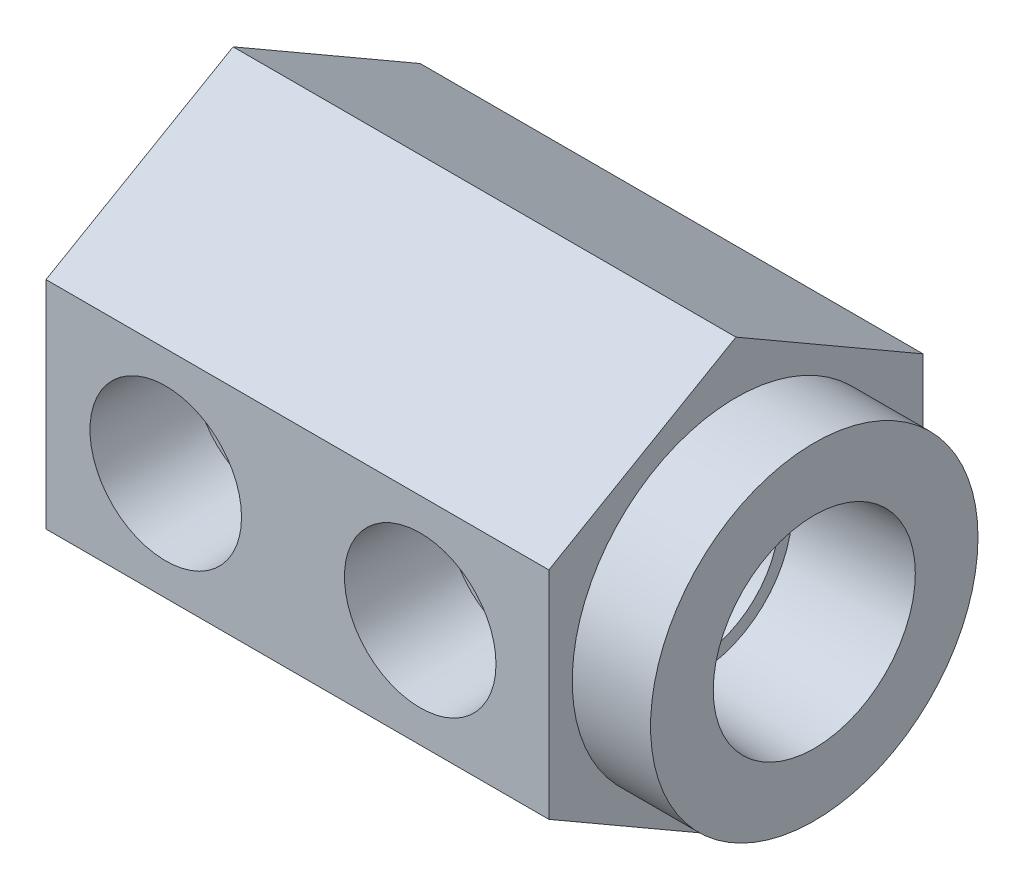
ISO-10303-21;
HEADER;
FILE_DESCRIPTION(('STEP AP214'),'2;1');
FILE_NAME('part.step','',(''),(''),'','','');
FILE_SCHEMA(('AUTOMOTIVE_DESIGN { 1 0 10303 214 1 1 1 1 }'));
ENDSEC;
DATA;
#1=APPLICATION_CONTEXT('core data for automotive mechanical design processes');
#2=APPLICATION_PROTOCOL_DEFINITION('international standard','automotive_design',2000,#1);
#3=PRODUCT_CONTEXT('',#1,'mechanical');
#4=PRODUCT('Part','Part','',(#3));
#5=PRODUCT_RELATED_PRODUCT_CATEGORY('part','',(#4));
#6=PRODUCT_DEFINITION_FORMATION('','',#4);
#7=PRODUCT_DEFINITION_CONTEXT('part definition',#1,'design');
#8=PRODUCT_DEFINITION('design','',#6,#7);
#9=PRODUCT_DEFINITION_SHAPE('','',#8);
#10=(LENGTH_UNIT() NAMED_UNIT(*) SI_UNIT(.MILLI.,.METRE.));
#11=(NAMED_UNIT(*) PLANE_ANGLE_UNIT() SI_UNIT($,.RADIAN.));
#12=(NAMED_UNIT(*) SI_UNIT($,.STERADIAN.) SOLID_ANGLE_UNIT());
#13=UNCERTAINTY_MEASURE_WITH_UNIT(LENGTH_MEASURE(1.E-05),#10,'distance_accuracy_value','');
#14=(GEOMETRIC_REPRESENTATION_CONTEXT(3) GLOBAL_UNCERTAINTY_ASSIGNED_CONTEXT((#13)) GLOBAL_UNIT_ASSIGNED_CONTEXT((#10,
#11,#12)) REPRESENTATION_CONTEXT('',''));
#15=CARTESIAN_POINT('',(0.,0.,0.));
#16=DIRECTION('',(0.,0.,1.));
#17=DIRECTION('',(1.,0.,0.));
#18=AXIS2_PLACEMENT_3D('',#15,#16,#17);
#19=CARTESIAN_POINT('',(39.44747,0.,0.));
#20=DIRECTION('',(1.,0.,0.));
#21=DIRECTION('',(0.,0.,-1.));
#22=AXIS2_PLACEMENT_3D('',#19,#20,#21);
#23=PLANE('',#22);
#24=CARTESIAN_POINT('',(39.44747,0.,0.));
#25=DIRECTION('',(1.,0.,0.));
#26=DIRECTION('',(0.,0.,-1.));
#27=AXIS2_PLACEMENT_3D('',#24,#25,#26);
#28=CIRCLE('',#27,11.1125);
#29=CARTESIAN_POINT('',(39.44747,0.,-11.1125));
#30=VERTEX_POINT('',#29);
#31=EDGE_CURVE('E130',#30,#30,#28,.T.);
#32=ORIENTED_EDGE('',*,*,#31,.T.);
#33=EDGE_LOOP('',(#32));
#34=FACE_BOUND('',#33,.T.);
#35=CARTESIAN_POINT('',(39.44747,0.,0.));
#36=DIRECTION('',(-1.,0.,0.));
#37=DIRECTION('',(0.,0.,1.));
#38=AXIS2_PLACEMENT_3D('',#35,#36,#37);
#39=CIRCLE('',#38,6.85806655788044);
#40=CARTESIAN_POINT('',(39.44747,0.,6.85806655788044));
#41=VERTEX_POINT('',#40);
#42=EDGE_CURVE('E256',#41,#41,#39,.T.);
#43=ORIENTED_EDGE('',*,*,#42,.T.);
#44=EDGE_LOOP('',(#43));
#45=FACE_BOUND('',#44,.T.);
#46=ADVANCED_FACE('F34',(#34,#45),#23,.T.);
#47=CARTESIAN_POINT('',(34.13125,-7.33234841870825,12.7));
#48=DIRECTION('',(1.,0.,0.));
#49=DIRECTION('',(0.,0.,-1.));
#50=AXIS2_PLACEMENT_3D('',#47,#48,#49);
#51=PLANE('',#50);
#52=DIRECTION('',(0.,-1.,0.));
#53=VECTOR('',#52,1.);
#54=CARTESIAN_POINT('',(34.13125,7.33234841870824,12.7));
#55=LINE('',#54,#53);
#56=CARTESIAN_POINT('',(34.13125,7.33234841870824,12.7));
#57=VERTEX_POINT('',#56);
#58=CARTESIAN_POINT('',(34.13125,-7.33234841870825,12.7));
#59=VERTEX_POINT('',#58);
#60=EDGE_CURVE('E137',#57,#59,#55,.T.);
#61=ORIENTED_EDGE('',*,*,#60,.T.);
#62=DIRECTION('',(0.,-0.5,-0.866025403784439));
#63=VECTOR('',#62,1.);
#64=CARTESIAN_POINT('',(34.13125,-7.33234841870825,12.7));
#65=LINE('',#64,#63);
#66=CARTESIAN_POINT('',(34.13125,-14.6646968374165,0.));
#67=VERTEX_POINT('',#66);
#68=EDGE_CURVE('E94',#59,#67,#65,.T.);
#69=ORIENTED_EDGE('',*,*,#68,.T.);
#70=DIRECTION('',(0.,0.5,-0.866025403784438));
#71=VECTOR('',#70,1.);
#72=CARTESIAN_POINT('',(34.13125,-14.6646968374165,0.));
#73=LINE('',#72,#71);
#74=CARTESIAN_POINT('',(34.13125,-7.33234841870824,-12.7));
#75=VERTEX_POINT('',#74);
#76=EDGE_CURVE('E108',#67,#75,#73,.T.);
#77=ORIENTED_EDGE('',*,*,#76,.T.);
#78=DIRECTION('',(0.,1.,0.));
#79=VECTOR('',#78,1.);
#80=CARTESIAN_POINT('',(34.13125,-7.33234841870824,-12.7));
#81=LINE('',#80,#79);
#82=CARTESIAN_POINT('',(34.13125,7.33234841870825,-12.7));
#83=VERTEX_POINT('',#82);
#84=EDGE_CURVE('E101',#75,#83,#81,.T.);
#85=ORIENTED_EDGE('',*,*,#84,.T.);
#86=DIRECTION('',(0.,0.5,0.866025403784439));
#87=VECTOR('',#86,1.);
#88=CARTESIAN_POINT('',(34.13125,7.33234841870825,-12.7));
#89=LINE('',#88,#87);
#90=CARTESIAN_POINT('',(34.13125,14.6646968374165,0.));
#91=VERTEX_POINT('',#90);
#92=EDGE_CURVE('E106',#83,#91,#89,.T.);
#93=ORIENTED_EDGE('',*,*,#92,.T.);
#94=DIRECTION('',(0.,-0.5,0.866025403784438));
#95=VECTOR('',#94,1.);
#96=CARTESIAN_POINT('',(34.13125,14.6646968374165,0.));
#97=LINE('',#96,#95);
#98=EDGE_CURVE('E57',#91,#57,#97,.T.);
#99=ORIENTED_EDGE('',*,*,#98,.T.);
#100=EDGE_LOOP('',(#61,#69,#77,#85,#93,#99));
#101=FACE_BOUND('',#100,.T.);
#102=CARTESIAN_POINT('',(34.13125,0.,0.));
#103=DIRECTION('',(1.,0.,0.));
#104=DIRECTION('',(0.,0.,-1.));
#105=AXIS2_PLACEMENT_3D('',#102,#103,#104);
#106=CIRCLE('',#105,11.1125);
#107=CARTESIAN_POINT('',(34.13125,0.,-11.1125));
#108=VERTEX_POINT('',#107);
#109=EDGE_CURVE('E249',#108,#108,#106,.T.);
#110=ORIENTED_EDGE('',*,*,#109,.F.);
#111=EDGE_LOOP('',(#110));
#112=FACE_BOUND('',#111,.T.);
#113=ADVANCED_FACE('F103',(#101,#112),#51,.T.);
#114=CARTESIAN_POINT('',(34.13125,7.33234841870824,12.7));
#115=DIRECTION('',(0.,0.,-1.));
#116=DIRECTION('',(0.,1.,0.));
#117=AXIS2_PLACEMENT_3D('',#114,#115,#116);
#118=PLANE('',#117);
#119=CARTESIAN_POINT('',(8.128,0.,12.7));
#120=DIRECTION('',(0.,0.,1.));
#121=DIRECTION('',(1.,0.,0.));
#122=AXIS2_PLACEMENT_3D('',#119,#120,#121);
#123=CIRCLE('',#122,5.1435);
#124=CARTESIAN_POINT('',(13.2715,0.,12.7));
#125=VERTEX_POINT('',#124);
#126=EDGE_CURVE('E278',#125,#125,#123,.T.);
#127=ORIENTED_EDGE('',*,*,#126,.F.);
#128=EDGE_LOOP('',(#127));
#129=FACE_BOUND('',#128,.T.);
#130=CARTESIAN_POINT('',(25.4,0.,12.7));
#131=DIRECTION('',(0.,0.,1.));
#132=DIRECTION('',(1.,0.,0.));
#133=AXIS2_PLACEMENT_3D('',#130,#131,#132);
#134=CIRCLE('',#133,5.1435);
#135=CARTESIAN_POINT('',(30.5435,0.,12.7));
#136=VERTEX_POINT('',#135);
#137=EDGE_CURVE('E269',#136,#136,#134,.T.);
#138=ORIENTED_EDGE('',*,*,#137,.F.);
#139=EDGE_LOOP('',(#138));
#140=FACE_BOUND('',#139,.T.);
#141=DIRECTION('',(0.,-1.,0.));
#142=VECTOR('',#141,1.);
#143=CARTESIAN_POINT('',(0.,7.33234841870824,12.7));
#144=LINE('',#143,#142);
#145=CARTESIAN_POINT('',(0.,7.33234841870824,12.7));
#146=VERTEX_POINT('',#145);
#147=CARTESIAN_POINT('',(0.,-7.33234841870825,12.7));
#148=VERTEX_POINT('',#147);
#149=EDGE_CURVE('E126',#146,#148,#144,.T.);
#150=ORIENTED_EDGE('',*,*,#149,.T.);
#151=DIRECTION('',(-1.,0.,0.));
#152=VECTOR('',#151,1.);
#153=CARTESIAN_POINT('',(34.13125,-7.33234841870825,12.7));
#154=LINE('',#153,#152);
#155=EDGE_CURVE('E11',#59,#148,#154,.T.);
#156=ORIENTED_EDGE('',*,*,#155,.F.);
#157=ORIENTED_EDGE('',*,*,#60,.F.);
#158=DIRECTION('',(-1.,0.,0.));
#159=VECTOR('',#158,1.);
#160=CARTESIAN_POINT('',(34.13125,7.33234841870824,12.7));
#161=LINE('',#160,#159);
#162=EDGE_CURVE('E122',#57,#146,#161,.T.);
#163=ORIENTED_EDGE('',*,*,#162,.T.);
#164=EDGE_LOOP('',(#150,#156,#157,#163));
#165=FACE_BOUND('',#164,.T.);
#166=ADVANCED_FACE('F36',(#129,#140,#165),#118,.F.);
#167=CARTESIAN_POINT('',(34.13125,-7.33234841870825,12.7));
#168=DIRECTION('',(0.,0.866025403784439,-0.5));
#169=DIRECTION('',(0.,0.5,0.866025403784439));
#170=AXIS2_PLACEMENT_3D('',#167,#168,#169);
#171=PLANE('',#170);
#172=DIRECTION('',(0.,-0.5,-0.866025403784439));
#173=VECTOR('',#172,1.);
#174=CARTESIAN_POINT('',(0.,-7.33234841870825,12.7));
#175=LINE('',#174,#173);
#176=CARTESIAN_POINT('',(0.,-14.6646968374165,0.));
#177=VERTEX_POINT('',#176);
#178=EDGE_CURVE('E129',#148,#177,#175,.T.);
#179=ORIENTED_EDGE('',*,*,#178,.T.);
#180=DIRECTION('',(-1.,0.,0.));
#181=VECTOR('',#180,1.);
#182=CARTESIAN_POINT('',(34.13125,-14.6646968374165,0.));
#183=LINE('',#182,#181);
#184=EDGE_CURVE('E48',#67,#177,#183,.T.);
#185=ORIENTED_EDGE('',*,*,#184,.F.);
#186=ORIENTED_EDGE('',*,*,#68,.F.);
#187=ORIENTED_EDGE('',*,*,#155,.T.);
#188=EDGE_LOOP('',(#179,#185,#186,#187));
#189=FACE_BOUND('',#188,.T.);
#190=ADVANCED_FACE('F234',(#189),#171,.F.);
#191=CARTESIAN_POINT('',(34.13125,-14.6646968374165,0.));
#192=DIRECTION('',(0.,0.866025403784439,0.5));
#193=DIRECTION('',(0.,-0.5,0.866025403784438));
#194=AXIS2_PLACEMENT_3D('',#191,#192,#193);
#195=PLANE('',#194);
#196=DIRECTION('',(0.,0.5,-0.866025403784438));
#197=VECTOR('',#196,1.);
#198=CARTESIAN_POINT('',(0.,-14.6646968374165,0.));
#199=LINE('',#198,#197);
#200=CARTESIAN_POINT('',(0.,-7.33234841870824,-12.7));
#201=VERTEX_POINT('',#200);
#202=EDGE_CURVE('E132',#177,#201,#199,.T.);
#203=ORIENTED_EDGE('',*,*,#202,.T.);
#204=DIRECTION('',(-1.,0.,0.));
#205=VECTOR('',#204,1.);
#206=CARTESIAN_POINT('',(34.13125,-7.33234841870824,-12.7));
#207=LINE('',#206,#205);
#208=EDGE_CURVE('E117',#75,#201,#207,.T.);
#209=ORIENTED_EDGE('',*,*,#208,.F.);
#210=ORIENTED_EDGE('',*,*,#76,.F.);
#211=ORIENTED_EDGE('',*,*,#184,.T.);
#212=EDGE_LOOP('',(#203,#209,#210,#211));
#213=FACE_BOUND('',#212,.T.);
#214=ADVANCED_FACE('F231',(#213),#195,.F.);
#215=CARTESIAN_POINT('',(34.13125,-7.33234841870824,-12.7));
#216=DIRECTION('',(0.,0.,1.));
#217=DIRECTION('',(0.,-1.,0.));
#218=AXIS2_PLACEMENT_3D('',#215,#216,#217);
#219=PLANE('',#218);
#220=CARTESIAN_POINT('',(8.128,0.,-12.7));
#221=DIRECTION('',(0.,0.,-1.));
#222=DIRECTION('',(0.,1.,0.));
#223=AXIS2_PLACEMENT_3D('',#220,#221,#222);
#224=CIRCLE('',#223,5.1435);
#225=CARTESIAN_POINT('',(8.128,5.1435,-12.7));
#226=VERTEX_POINT('',#225);
#227=EDGE_CURVE('E287',#226,#226,#224,.T.);
#228=ORIENTED_EDGE('',*,*,#227,.F.);
#229=EDGE_LOOP('',(#228));
#230=FACE_BOUND('',#229,.T.);
#231=DIRECTION('',(0.,1.,0.));
#232=VECTOR('',#231,1.);
#233=CARTESIAN_POINT('',(0.,-7.33234841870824,-12.7));
#234=LINE('',#233,#232);
#235=CARTESIAN_POINT('',(0.,7.33234841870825,-12.7));
#236=VERTEX_POINT('',#235);
#237=EDGE_CURVE('E116',#201,#236,#234,.T.);
#238=ORIENTED_EDGE('',*,*,#237,.T.);
#239=DIRECTION('',(-1.,0.,0.));
#240=VECTOR('',#239,1.);
#241=CARTESIAN_POINT('',(34.13125,7.33234841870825,-12.7));
#242=LINE('',#241,#240);
#243=EDGE_CURVE('E113',#83,#236,#242,.T.);
#244=ORIENTED_EDGE('',*,*,#243,.F.);
#245=ORIENTED_EDGE('',*,*,#84,.F.);
#246=ORIENTED_EDGE('',*,*,#208,.T.);
#247=EDGE_LOOP('',(#238,#244,#245,#246));
#248=FACE_BOUND('',#247,.T.);
#249=ADVANCED_FACE('F114',(#230,#248),#219,.F.);
#250=CARTESIAN_POINT('',(34.13125,7.33234841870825,-12.7));
#251=DIRECTION('',(0.,-0.866025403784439,0.5));
#252=DIRECTION('',(0.,-0.5,-0.866025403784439));
#253=AXIS2_PLACEMENT_3D('',#250,#251,#252);
#254=PLANE('',#253);
#255=DIRECTION('',(0.,0.5,0.866025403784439));
#256=VECTOR('',#255,1.);
#257=CARTESIAN_POINT('',(0.,7.33234841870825,-12.7));
#258=LINE('',#257,#256);
#259=CARTESIAN_POINT('',(0.,14.6646968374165,0.));
#260=VERTEX_POINT('',#259);
#261=EDGE_CURVE('E80',#236,#260,#258,.T.);
#262=ORIENTED_EDGE('',*,*,#261,.T.);
#263=DIRECTION('',(-1.,0.,0.));
#264=VECTOR('',#263,1.);
#265=CARTESIAN_POINT('',(34.13125,14.6646968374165,0.));
#266=LINE('',#265,#264);
#267=EDGE_CURVE('E118',#91,#260,#266,.T.);
#268=ORIENTED_EDGE('',*,*,#267,.F.);
#269=ORIENTED_EDGE('',*,*,#92,.F.);
#270=ORIENTED_EDGE('',*,*,#243,.T.);
#271=EDGE_LOOP('',(#262,#268,#269,#270));
#272=FACE_BOUND('',#271,.T.);
#273=ADVANCED_FACE('F120',(#272),#254,.F.);
#274=CARTESIAN_POINT('',(34.13125,14.6646968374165,0.));
#275=DIRECTION('',(0.,-0.866025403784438,-0.5));
#276=DIRECTION('',(0.,0.5,-0.866025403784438));
#277=AXIS2_PLACEMENT_3D('',#274,#275,#276);
#278=PLANE('',#277);
#279=DIRECTION('',(0.,-0.5,0.866025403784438));
#280=VECTOR('',#279,1.);
#281=CARTESIAN_POINT('',(0.,14.6646968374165,0.));
#282=LINE('',#281,#280);
#283=EDGE_CURVE('E86',#260,#146,#282,.T.);
#284=ORIENTED_EDGE('',*,*,#283,.T.);
#285=ORIENTED_EDGE('',*,*,#162,.F.);
#286=ORIENTED_EDGE('',*,*,#98,.F.);
#287=ORIENTED_EDGE('',*,*,#267,.T.);
#288=EDGE_LOOP('',(#284,#285,#286,#287));
#289=FACE_BOUND('',#288,.T.);
#290=ADVANCED_FACE('F223',(#289),#278,.F.);
#291=CARTESIAN_POINT('',(0.,-7.33234841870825,12.7));
#292=DIRECTION('',(1.,0.,0.));
#293=DIRECTION('',(0.,0.,-1.));
#294=AXIS2_PLACEMENT_3D('',#291,#292,#293);
#295=PLANE('',#294);
#296=ORIENTED_EDGE('',*,*,#149,.F.);
#297=ORIENTED_EDGE('',*,*,#283,.F.);
#298=ORIENTED_EDGE('',*,*,#261,.F.);
#299=ORIENTED_EDGE('',*,*,#237,.F.);
#300=ORIENTED_EDGE('',*,*,#202,.F.);
#301=ORIENTED_EDGE('',*,*,#178,.F.);
#302=EDGE_LOOP('',(#296,#297,#298,#299,#300,#301));
#303=FACE_BOUND('',#302,.T.);
#304=ADVANCED_FACE('F218',(#303),#295,.F.);
#305=CARTESIAN_POINT('',(39.44747,0.,0.));
#306=DIRECTION('',(-1.,0.,0.));
#307=DIRECTION('',(0.,0.,1.));
#308=AXIS2_PLACEMENT_3D('',#305,#306,#307);
#309=CYLINDRICAL_SURFACE('',#308,11.1125);
#310=ORIENTED_EDGE('',*,*,#31,.F.);
#311=EDGE_LOOP('',(#310));
#312=FACE_BOUND('',#311,.T.);
#313=ORIENTED_EDGE('',*,*,#109,.T.);
#314=EDGE_LOOP('',(#313));
#315=FACE_BOUND('',#314,.T.);
#316=ADVANCED_FACE('F216',(#312,#315),#309,.T.);
#317=CARTESIAN_POINT('',(31.50997,5.55625,0.));
#318=DIRECTION('',(1.,0.,0.));
#319=DIRECTION('',(0.,0.,-1.));
#320=AXIS2_PLACEMENT_3D('',#317,#318,#319);
#321=PLANE('',#320);
#322=CARTESIAN_POINT('',(31.50997,0.,0.));
#323=DIRECTION('',(-1.,0.,0.));
#324=DIRECTION('',(0.,0.,1.));
#325=AXIS2_PLACEMENT_3D('',#322,#323,#324);
#326=CIRCLE('',#325,5.55625);
#327=CARTESIAN_POINT('',(31.50997,0.,5.55625));
#328=VERTEX_POINT('',#327);
#329=EDGE_CURVE('E149',#328,#328,#326,.T.);
#330=ORIENTED_EDGE('',*,*,#329,.T.);
#331=EDGE_LOOP('',(#330));
#332=FACE_BOUND('',#331,.T.);
#333=CARTESIAN_POINT('',(31.50997,0.,0.));
#334=DIRECTION('',(-1.,0.,0.));
#335=DIRECTION('',(0.,0.,1.));
#336=AXIS2_PLACEMENT_3D('',#333,#334,#335);
#337=CIRCLE('',#336,6.44207980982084);
#338=CARTESIAN_POINT('',(31.50997,0.,6.44207980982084));
#339=VERTEX_POINT('',#338);
#340=EDGE_CURVE('E252',#339,#339,#337,.T.);
#341=ORIENTED_EDGE('',*,*,#340,.F.);
#342=EDGE_LOOP('',(#341));
#343=FACE_BOUND('',#342,.T.);
#344=ADVANCED_FACE('F214',(#332,#343),#321,.T.);
#345=CARTESIAN_POINT('',(39.44747,0.,0.));
#346=DIRECTION('',(1.,0.,0.));
#347=DIRECTION('',(0.,0.,-1.));
#348=AXIS2_PLACEMENT_3D('',#345,#346,#347);
#349=CONICAL_SURFACE('',#348,6.85806655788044,0.0523598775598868);
#350=ORIENTED_EDGE('',*,*,#340,.T.);
#351=EDGE_LOOP('',(#350));
#352=FACE_BOUND('',#351,.T.);
#353=ORIENTED_EDGE('',*,*,#42,.F.);
#354=EDGE_LOOP('',(#353));
#355=FACE_BOUND('',#354,.T.);
#356=ADVANCED_FACE('F321',(#352,#355),#349,.F.);
#357=CARTESIAN_POINT('',(21.03247,0.,0.));
#358=DIRECTION('',(1.,0.,0.));
#359=DIRECTION('',(0.,0.,-1.));
#360=AXIS2_PLACEMENT_3D('',#357,#358,#359);
#361=PLANE('',#360);
#362=CARTESIAN_POINT('',(21.03247,0.,0.));
#363=DIRECTION('',(1.,0.,0.));
#364=DIRECTION('',(0.,0.,-1.));
#365=AXIS2_PLACEMENT_3D('',#362,#363,#364);
#366=CIRCLE('',#365,3.17499999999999);
#367=CARTESIAN_POINT('',(21.03247,0.,-3.17499999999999));
#368=VERTEX_POINT('',#367);
#369=EDGE_CURVE('E151',#368,#368,#366,.T.);
#370=ORIENTED_EDGE('',*,*,#369,.F.);
#371=EDGE_LOOP('',(#370));
#372=FACE_BOUND('',#371,.T.);
#373=CARTESIAN_POINT('',(21.03247,0.,0.));
#374=DIRECTION('',(-1.,0.,0.));
#375=DIRECTION('',(0.,0.,1.));
#376=AXIS2_PLACEMENT_3D('',#373,#374,#375);
#377=CIRCLE('',#376,5.55625);
#378=CARTESIAN_POINT('',(21.03247,0.,5.55625));
#379=VERTEX_POINT('',#378);
#380=EDGE_CURVE('E259',#379,#379,#377,.T.);
#381=ORIENTED_EDGE('',*,*,#380,.F.);
#382=EDGE_LOOP('',(#381));
#383=FACE_BOUND('',#382,.T.);
#384=ADVANCED_FACE('F318',(#372,#383),#361,.T.);
#385=CARTESIAN_POINT('',(0.,0.,0.));
#386=DIRECTION('',(-1.,0.,0.));
#387=DIRECTION('',(0.,0.,1.));
#388=AXIS2_PLACEMENT_3D('',#385,#386,#387);
#389=CYLINDRICAL_SURFACE('',#388,5.55625);
#390=CARTESIAN_POINT('',(29.6164,0.,5.55625));
#391=CARTESIAN_POINT('',(29.6163993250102,-0.102693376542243,5.55624935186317));
#392=CARTESIAN_POINT('',(29.6126418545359,-0.205397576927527,5.55339643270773));
#393=CARTESIAN_POINT('',(29.5976742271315,-0.409987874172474,5.54205114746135));
#394=CARTESIAN_POINT('',(29.586460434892,-0.511873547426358,5.53355603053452));
#395=CARTESIAN_POINT('',(29.5567421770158,-0.714130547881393,5.51110649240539));
#396=CARTESIAN_POINT('',(29.5382264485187,-0.814499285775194,5.49714363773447));
#397=CARTESIAN_POINT('',(29.4942051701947,-1.01284455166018,5.46408215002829));
#398=CARTESIAN_POINT('',(29.4686965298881,-1.11082000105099,5.44498124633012));
#399=CARTESIAN_POINT('',(29.3825831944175,-1.39891797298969,5.38083315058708));
#400=CARTESIAN_POINT('',(29.3121704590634,-1.58466430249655,5.32877063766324));
#401=CARTESIAN_POINT('',(29.1485378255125,-1.94034128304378,5.20982470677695));
#402=CARTESIAN_POINT('',(29.0553219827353,-2.11027473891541,5.1429439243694));
#403=CARTESIAN_POINT('',(28.8395703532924,-2.44767830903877,4.99179767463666));
#404=CARTESIAN_POINT('',(28.7151124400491,-2.61344503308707,4.90649322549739));
#405=CARTESIAN_POINT('',(28.445557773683,-2.92315956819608,4.72852964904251));
#406=CARTESIAN_POINT('',(28.300430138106,-3.06707405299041,4.63585961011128));
#407=CARTESIAN_POINT('',(28.0527623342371,-3.27963118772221,4.48615059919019));
#408=CARTESIAN_POINT('',(27.9560898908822,-3.35552727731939,4.42952031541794));
#409=CARTESIAN_POINT('',(27.7560755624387,-3.49886885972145,4.31718819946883));
#410=CARTESIAN_POINT('',(27.6527316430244,-3.56631175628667,4.26148665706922));
#411=CARTESIAN_POINT('',(27.4395786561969,-3.69235121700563,4.15275532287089));
#412=CARTESIAN_POINT('',(27.3297756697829,-3.75095592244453,4.09972310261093));
#413=CARTESIAN_POINT('',(27.1037486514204,-3.85888092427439,3.99830378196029));
#414=CARTESIAN_POINT('',(26.9875283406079,-3.90820652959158,3.94991403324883));
#415=CARTESIAN_POINT('',(26.7125548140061,-4.01032101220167,3.84655569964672));
#416=CARTESIAN_POINT('',(26.5515353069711,-4.05967723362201,3.79399633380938));
#417=CARTESIAN_POINT('',(26.3032358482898,-4.11939822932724,3.72871892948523));
#418=CARTESIAN_POINT('',(26.2193920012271,-4.13691360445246,3.70922751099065));
#419=CARTESIAN_POINT('',(26.0497879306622,-4.1669184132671,3.67548846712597));
#420=CARTESIAN_POINT('',(25.9640287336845,-4.17941047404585,3.66123810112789));
#421=CARTESIAN_POINT('',(25.7902465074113,-4.19922159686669,3.63850031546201));
#422=CARTESIAN_POINT('',(25.702209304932,-4.20648654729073,3.63007321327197));
#423=CARTESIAN_POINT('',(25.5254696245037,-4.21546136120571,3.61964744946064));
#424=CARTESIAN_POINT('',(25.4367671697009,-4.21717141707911,3.61764856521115));
#425=CARTESIAN_POINT('',(25.25950294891,-4.21499058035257,3.62018953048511));
#426=CARTESIAN_POINT('',(25.1709412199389,-4.21109840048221,3.62473088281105));
#427=CARTESIAN_POINT('',(24.9948050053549,-4.19781579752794,3.64010347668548));
#428=CARTESIAN_POINT('',(24.9072305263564,-4.18842533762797,3.65093476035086));
#429=CARTESIAN_POINT('',(24.6670671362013,-4.15509038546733,3.68893056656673));
#430=CARTESIAN_POINT('',(24.5161923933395,-4.12550713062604,3.72225050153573));
#431=CARTESIAN_POINT('',(24.2220882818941,-4.05137671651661,3.80278947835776));
#432=CARTESIAN_POINT('',(24.0788668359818,-4.00681438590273,3.85002260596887));
#433=CARTESIAN_POINT('',(23.8260179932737,-3.91348438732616,3.94463534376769));
#434=CARTESIAN_POINT('',(23.7149764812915,-3.86690895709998,3.99046546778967));
#435=CARTESIAN_POINT('',(23.4987398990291,-3.76530472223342,4.08647520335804));
#436=CARTESIAN_POINT('',(23.3935479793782,-3.71027142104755,4.13665712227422));
#437=CARTESIAN_POINT('',(23.1888896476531,-3.59207638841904,4.2397008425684));
#438=CARTESIAN_POINT('',(23.0894357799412,-3.52889775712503,4.29256807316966));
#439=CARTESIAN_POINT('',(22.896560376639,-3.39479221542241,4.39939220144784));
#440=CARTESIAN_POINT('',(22.8031378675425,-3.32386656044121,4.45334892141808));
#441=CARTESIAN_POINT('',(22.6198789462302,-3.17229987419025,4.56260828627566));
#442=CARTESIAN_POINT('',(22.5302195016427,-3.09144027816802,4.61790568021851));
#443=CARTESIAN_POINT('',(22.3577105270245,-2.92184039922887,4.72704545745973));
#444=CARTESIAN_POINT('',(22.274863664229,-2.83309705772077,4.78088726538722));
#445=CARTESIAN_POINT('',(22.0375306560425,-2.55557286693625,4.93821773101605));
#446=CARTESIAN_POINT('',(21.893717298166,-2.3550581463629,5.03784133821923));
#447=CARTESIAN_POINT('',(21.6649881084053,-1.96676092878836,5.19991035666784));
#448=CARTESIAN_POINT('',(21.5740623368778,-1.783982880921,5.26582042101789));
#449=CARTESIAN_POINT('',(21.4573057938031,-1.49794068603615,5.35145144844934));
#450=CARTESIAN_POINT('',(21.421651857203,-1.40058567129,5.37779487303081));
#451=CARTESIAN_POINT('',(21.3573496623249,-1.20243166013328,5.42553595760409));
#452=CARTESIAN_POINT('',(21.3286983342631,-1.10163419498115,5.44693578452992));
#453=CARTESIAN_POINT('',(21.2786470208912,-0.896496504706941,5.48444704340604));
#454=CARTESIAN_POINT('',(21.2573003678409,-0.792136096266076,5.50051955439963));
#455=CARTESIAN_POINT('',(21.2225152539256,-0.581416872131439,5.52676517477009));
#456=CARTESIAN_POINT('',(21.2090731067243,-0.475059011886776,5.53694103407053));
#457=CARTESIAN_POINT('',(21.1903325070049,-0.261235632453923,5.55113934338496));
#458=CARTESIAN_POINT('',(21.1850326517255,-0.1537703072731,5.55516285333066));
#459=CARTESIAN_POINT('',(21.1826743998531,0.0612961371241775,5.5569523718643));
#460=CARTESIAN_POINT('',(21.1856152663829,0.168897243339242,5.55471893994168));
#461=CARTESIAN_POINT('',(21.1989208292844,0.371674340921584,5.5446311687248));
#462=CARTESIAN_POINT('',(21.2084499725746,0.466937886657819,5.53740954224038));
#463=CARTESIAN_POINT('',(21.2338694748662,0.656134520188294,5.51819377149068));
#464=CARTESIAN_POINT('',(21.2497618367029,0.750067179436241,5.50619812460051));
#465=CARTESIAN_POINT('',(21.3066724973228,1.0288748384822,5.46338413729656));
#466=CARTESIAN_POINT('',(21.356935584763,1.21092313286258,5.42573004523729));
#467=CARTESIAN_POINT('',(21.4812624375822,1.56789963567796,5.33372302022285));
#468=CARTESIAN_POINT('',(21.5559374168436,1.74249866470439,5.27894302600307));
#469=CARTESIAN_POINT('',(21.7256433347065,2.07659649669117,5.15667714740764));
#470=CARTESIAN_POINT('',(21.8206773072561,2.23609304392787,5.08918936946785));
#471=CARTESIAN_POINT('',(22.0455518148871,2.56347572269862,4.93341300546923));
#472=CARTESIAN_POINT('',(22.1785466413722,2.72842274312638,4.8435290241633));
#473=CARTESIAN_POINT('',(22.4657559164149,3.03521371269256,4.65742624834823));
#474=CARTESIAN_POINT('',(22.6200134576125,3.17700943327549,4.56119480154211));
#475=CARTESIAN_POINT('',(22.8821039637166,3.38436105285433,4.40765179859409));
#476=CARTESIAN_POINT('',(22.9837901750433,3.45770845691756,4.35018681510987));
#477=CARTESIAN_POINT('',(23.1940490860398,3.59549974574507,4.23700773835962));
#478=CARTESIAN_POINT('',(23.3026242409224,3.65994042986,4.18129428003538));
#479=CARTESIAN_POINT('',(23.5263714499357,3.77936334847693,4.07366880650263));
#480=CARTESIAN_POINT('',(23.6415306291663,3.8343632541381,4.02174979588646));
#481=CARTESIAN_POINT('',(23.8784440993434,3.93439147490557,3.92394754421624));
#482=CARTESIAN_POINT('',(24.0001932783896,3.97942738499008,3.8780597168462));
#483=CARTESIAN_POINT('',(24.2790144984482,4.06784554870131,3.78544072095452));
#484=CARTESIAN_POINT('',(24.4377707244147,4.10846555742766,3.74094260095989));
#485=CARTESIAN_POINT('',(24.6813970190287,4.15553716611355,3.6883562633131));
#486=CARTESIAN_POINT('',(24.7634690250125,4.16891399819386,3.67319259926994));
#487=CARTESIAN_POINT('',(24.9290383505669,4.19084532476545,3.64815156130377));
#488=CARTESIAN_POINT('',(25.0125349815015,4.19940208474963,3.63827170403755));
#489=CARTESIAN_POINT('',(25.1809809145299,4.21156059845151,3.62419089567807));
#490=CARTESIAN_POINT('',(25.2659363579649,4.21512601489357,3.62003159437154));
#491=CARTESIAN_POINT('',(25.4359878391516,4.21710364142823,3.61772767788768));
#492=CARTESIAN_POINT('',(25.5210838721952,4.21551602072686,3.61958286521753));
#493=CARTESIAN_POINT('',(25.69074369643,4.20722188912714,3.629219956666));
#494=CARTESIAN_POINT('',(25.7753070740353,4.20051180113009,3.63700600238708));
#495=CARTESIAN_POINT('',(25.9432169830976,4.1821148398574,3.65814491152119));
#496=CARTESIAN_POINT('',(26.0265628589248,4.17042538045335,3.67150066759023));
#497=CARTESIAN_POINT('',(26.2053377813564,4.13992798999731,3.70587659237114));
#498=CARTESIAN_POINT('',(26.3004441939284,4.1202540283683,3.72780747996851));
#499=CARTESIAN_POINT('',(26.4876880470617,4.07483267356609,3.77740472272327));
#500=CARTESIAN_POINT('',(26.5798232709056,4.0490808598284,3.80507525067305));
#501=CARTESIAN_POINT('',(26.8515481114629,3.9632252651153,3.89507311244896));
#502=CARTESIAN_POINT('',(27.0262161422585,3.89456404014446,3.9643352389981));
#503=CARTESIAN_POINT('',(27.3096983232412,3.76132382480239,4.0902354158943));
#504=CARTESIAN_POINT('',(27.4222798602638,3.70195130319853,4.14423023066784));
#505=CARTESIAN_POINT('',(27.6406852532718,3.57398466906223,4.25507997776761));
#506=CARTESIAN_POINT('',(27.7465066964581,3.50538729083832,4.31193591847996));
#507=CARTESIAN_POINT('',(27.9513183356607,3.35926316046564,4.42672704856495));
#508=CARTESIAN_POINT('',(28.0503021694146,3.28172826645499,4.48466318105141));
#509=CARTESIAN_POINT('',(28.2411263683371,3.11798488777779,4.60001225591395));
#510=CARTESIAN_POINT('',(28.332967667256,3.03177754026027,4.65742526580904));
#511=CARTESIAN_POINT('',(28.5103676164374,2.84956733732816,4.77111867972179));
#512=CARTESIAN_POINT('',(28.5958206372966,2.75344451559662,4.82737207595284));
#513=CARTESIAN_POINT('',(28.7584200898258,2.55259396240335,4.93652120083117));
#514=CARTESIAN_POINT('',(28.8355654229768,2.44786509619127,4.98941648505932));
#515=CARTESIAN_POINT('',(28.9806112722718,2.23031622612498,5.09037894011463));
#516=CARTESIAN_POINT('',(29.048528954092,2.11751185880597,5.13845503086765));
#517=CARTESIAN_POINT('',(29.1743228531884,1.88416115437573,5.22852473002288));
#518=CARTESIAN_POINT('',(29.232203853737,1.76361854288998,5.27052123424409));
#519=CARTESIAN_POINT('',(29.3221097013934,1.55061985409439,5.3363074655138));
#520=CARTESIAN_POINT('',(29.3568210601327,1.45984111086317,5.36189016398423));
#521=CARTESIAN_POINT('',(29.420152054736,1.27512063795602,5.40879414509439));
#522=CARTESIAN_POINT('',(29.448773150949,1.18117967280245,5.43011644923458));
#523=CARTESIAN_POINT('',(29.4995054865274,0.990840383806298,5.46804785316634));
#524=CARTESIAN_POINT('',(29.5216302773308,0.894447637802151,5.48466676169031));
#525=CARTESIAN_POINT('',(29.5591251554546,0.699668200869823,5.51289892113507));
#526=CARTESIAN_POINT('',(29.5744981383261,0.601282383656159,5.52451431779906));
#527=CARTESIAN_POINT('',(29.5963476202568,0.419165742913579,5.54104473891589));
#528=CARTESIAN_POINT('',(29.6038584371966,0.335627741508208,5.54673779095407));
#529=CARTESIAN_POINT('',(29.6138854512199,0.168062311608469,5.55434110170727));
#530=CARTESIAN_POINT('',(29.6164005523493,0.0840347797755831,5.55625053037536));
#531=CARTESIAN_POINT('',(29.6164,0.,5.55625));
#532=B_SPLINE_CURVE_WITH_KNOTS('',3,(#390,#391,#392,#393,#394,#395,#396,#397,#398,#399,#400,
#401,#402,#403,#404,#405,#406,#407,#408,#409,#410,#411,#412,#413,#414,#415,#416,#417,#418,#419,
#420,#421,#422,#423,#424,#425,#426,#427,#428,#429,#430,#431,#432,#433,#434,#435,#436,#437,#438,
#439,#440,#441,#442,#443,#444,#445,#446,#447,#448,#449,#450,#451,#452,#453,#454,#455,#456,#457,
#458,#459,#460,#461,#462,#463,#464,#465,#466,#467,#468,#469,#470,#471,#472,#473,#474,#475,#476,
#477,#478,#479,#480,#481,#482,#483,#484,#485,#486,#487,#488,#489,#490,#491,#492,#493,#494,#495,
#496,#497,#498,#499,#500,#501,#502,#503,#504,#505,#506,#507,#508,#509,#510,#511,#512,#513,#514,
#515,#516,#517,#518,#519,#520,#521,#522,#523,#524,#525,#526,#527,#528,#529,#530,#531),
.UNSPECIFIED.,.T.,.F.,(4,2,2,2,2,2,2,2,2,2,2,2,2,2,2,2,2,2,2,2,2,2,2,2,2,2,2,2,2,2,2,2,2,2,2,2,
2,2,2,2,2,2,2,2,2,2,2,2,2,2,2,2,2,2,2,2,2,2,2,2,2,2,2,2,2,2,2,2,2,2,4),(0.,0.307991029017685,
0.616132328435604,0.924750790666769,1.2335058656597,1.84663803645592,2.459661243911,
3.12977733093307,3.80090534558,4.20650775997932,4.61223444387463,5.01758508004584,
5.42270308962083,5.94985658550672,6.21312560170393,6.47625675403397,6.74207413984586,
7.00788231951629,7.27375158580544,7.53962263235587,8.00965097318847,8.48015681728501,
8.86617029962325,9.25238971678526,9.63942375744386,10.0263951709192,10.4243466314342,
10.8224531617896,11.6163911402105,12.2571875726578,12.5777622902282,12.8981962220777,
13.2209221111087,13.5434973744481,13.8660170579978,14.1885079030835,14.4761906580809,
14.7639640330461,15.3390242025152,15.9297539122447,16.5205717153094,17.2086216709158,
17.8980871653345,18.3114499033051,18.7249608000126,19.1376890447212,19.5501015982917,
20.057359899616,20.3106781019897,20.563877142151,20.8189100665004,21.0739346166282,
21.3291374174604,21.5844729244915,21.8827088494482,22.1811623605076,22.7788098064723,
23.1931606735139,23.6076586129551,24.0225371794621,24.4373614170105,24.857977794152,
25.2786497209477,25.6985280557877,26.118205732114,26.4194112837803,26.720544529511,
27.021045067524,27.3214166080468,27.5733927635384,27.8254241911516),.UNSPECIFIED.);
#533=CARTESIAN_POINT('',(29.6164,0.,5.55625));
#534=VERTEX_POINT('',#533);
#535=EDGE_CURVE('E143',#534,#534,#532,.T.);
#536=ORIENTED_EDGE('',*,*,#535,.F.);
#537=EDGE_LOOP('',(#536));
#538=FACE_BOUND('',#537,.T.);
#539=ORIENTED_EDGE('',*,*,#380,.T.);
#540=EDGE_LOOP('',(#539));
#541=FACE_BOUND('',#540,.T.);
#542=ORIENTED_EDGE('',*,*,#329,.F.);
#543=EDGE_LOOP('',(#542));
#544=FACE_BOUND('',#543,.T.);
#545=ADVANCED_FACE('F152',(#538,#541,#544),#389,.F.);
#546=CARTESIAN_POINT('',(25.4,0.,12.7));
#547=DIRECTION('',(0.,0.,1.));
#548=DIRECTION('',(1.,0.,0.));
#549=AXIS2_PLACEMENT_3D('',#546,#547,#548);
#550=CYLINDRICAL_SURFACE('',#549,4.2164);
#551=ORIENTED_EDGE('',*,*,#535,.T.);
#552=EDGE_LOOP('',(#551));
#553=FACE_BOUND('',#552,.T.);
#554=CARTESIAN_POINT('',(25.4,0.,5.77596));
#555=DIRECTION('',(0.,0.,1.));
#556=DIRECTION('',(1.,0.,0.));
#557=AXIS2_PLACEMENT_3D('',#554,#555,#556);
#558=CIRCLE('',#557,4.2164);
#559=CARTESIAN_POINT('',(29.6164,0.,5.77596));
#560=VERTEX_POINT('',#559);
#561=EDGE_CURVE('E150',#560,#560,#558,.T.);
#562=ORIENTED_EDGE('',*,*,#561,.T.);
#563=EDGE_LOOP('',(#562));
#564=FACE_BOUND('',#563,.T.);
#565=ADVANCED_FACE('F155',(#553,#564),#550,.F.);
#566=CARTESIAN_POINT('',(29.6164,0.,5.77596));
#567=DIRECTION('',(0.,0.,-1.));
#568=DIRECTION('',(-1.,0.,0.));
#569=AXIS2_PLACEMENT_3D('',#566,#567,#568);
#570=PLANE('',#569);
#571=ORIENTED_EDGE('',*,*,#561,.F.);
#572=EDGE_LOOP('',(#571));
#573=FACE_BOUND('',#572,.T.);
#574=CARTESIAN_POINT('',(25.4,0.,5.77596));
#575=DIRECTION('',(0.,0.,1.));
#576=DIRECTION('',(1.,0.,0.));
#577=AXIS2_PLACEMENT_3D('',#574,#575,#576);
#578=CIRCLE('',#577,4.93618496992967);
#579=CARTESIAN_POINT('',(30.3361849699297,0.,5.77596));
#580=VERTEX_POINT('',#579);
#581=EDGE_CURVE('E266',#580,#580,#578,.T.);
#582=ORIENTED_EDGE('',*,*,#581,.T.);
#583=EDGE_LOOP('',(#582));
#584=FACE_BOUND('',#583,.T.);
#585=ADVANCED_FACE('F159',(#573,#584),#570,.F.);
#586=CARTESIAN_POINT('',(25.4,0.,12.7));
#587=DIRECTION('',(0.,0.,1.));
#588=DIRECTION('',(1.,0.,0.));
#589=AXIS2_PLACEMENT_3D('',#586,#587,#588);
#590=CONICAL_SURFACE('',#589,5.1435,0.0299323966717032);
#591=ORIENTED_EDGE('',*,*,#581,.F.);
#592=EDGE_LOOP('',(#591));
#593=FACE_BOUND('',#592,.T.);
#594=ORIENTED_EDGE('',*,*,#137,.T.);
#595=EDGE_LOOP('',(#594));
#596=FACE_BOUND('',#595,.T.);
#597=ADVANCED_FACE('F163',(#593,#596),#590,.F.);
#598=CARTESIAN_POINT('',(8.128,0.,12.7));
#599=DIRECTION('',(0.,0.,1.));
#600=DIRECTION('',(1.,0.,0.));
#601=AXIS2_PLACEMENT_3D('',#598,#599,#600);
#602=CYLINDRICAL_SURFACE('',#601,4.2164);
#603=CARTESIAN_POINT('',(12.3444,0.,-2.77812499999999));
#604=CARTESIAN_POINT('',(12.3443955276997,0.139883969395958,-2.77811997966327));
#605=CARTESIAN_POINT('',(12.3373755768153,0.279800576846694,-2.76749868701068));
#606=CARTESIAN_POINT('',(12.3099836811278,0.555187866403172,-2.72565235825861));
#607=CARTESIAN_POINT('',(12.2896031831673,0.6906556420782,-2.69441412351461));
#608=CARTESIAN_POINT('',(12.2375104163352,0.952754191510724,-2.61323304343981));
#609=CARTESIAN_POINT('',(12.2058514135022,1.07942321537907,-2.56337806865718));
#610=CARTESIAN_POINT('',(12.1337605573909,1.32210407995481,-2.44706908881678));
#611=CARTESIAN_POINT('',(12.0933275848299,1.4381145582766,-2.38061296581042));
#612=CARTESIAN_POINT('',(12.0029110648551,1.66718281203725,-2.22689910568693));
#613=CARTESIAN_POINT('',(11.9524106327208,1.77917454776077,-2.13836318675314));
#614=CARTESIAN_POINT('',(11.8482905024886,1.98773409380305,-1.94603559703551));
#615=CARTESIAN_POINT('',(11.7946664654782,2.08427971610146,-1.84222238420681));
#616=CARTESIAN_POINT('',(11.680384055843,2.27435151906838,-1.60375038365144));
#617=CARTESIAN_POINT('',(11.6199096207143,2.36513867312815,-1.46680289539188));
#618=CARTESIAN_POINT('',(11.5081634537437,2.52226630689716,-1.17614753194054));
#619=CARTESIAN_POINT('',(11.4568758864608,2.58864906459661,-1.02246924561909));
#620=CARTESIAN_POINT('',(11.3845681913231,2.6786449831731,-0.746661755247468));
#621=CARTESIAN_POINT('',(11.3590896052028,2.70904686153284,-0.627927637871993));
#622=CARTESIAN_POINT('',(11.3208802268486,2.75398593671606,-0.385574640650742));
#623=CARTESIAN_POINT('',(11.3081282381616,2.76854951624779,-0.261964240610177));
#624=CARTESIAN_POINT('',(11.2973346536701,2.78090423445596,-0.0127670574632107));
#625=CARTESIAN_POINT('',(11.299348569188,2.77863208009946,0.112825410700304));
#626=CARTESIAN_POINT('',(11.3178791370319,2.75733196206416,0.361533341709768));
#627=CARTESIAN_POINT('',(11.3344080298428,2.73828985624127,0.484646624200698));
#628=CARTESIAN_POINT('',(11.3785253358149,2.68574292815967,0.720261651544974));
#629=CARTESIAN_POINT('',(11.405649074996,2.65284171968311,0.832990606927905));
#630=CARTESIAN_POINT('',(11.4678512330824,2.57408907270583,1.05144792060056));
#631=CARTESIAN_POINT('',(11.5029322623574,2.52823338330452,1.15717396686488));
#632=CARTESIAN_POINT('',(11.5855849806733,2.41433509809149,1.38122293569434));
#633=CARTESIAN_POINT('',(11.6342504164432,2.34368656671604,1.49781446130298));
#634=CARTESIAN_POINT('',(11.7342078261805,2.18677186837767,1.71883915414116));
#635=CARTESIAN_POINT('',(11.7855029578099,2.10048659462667,1.82325718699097));
#636=CARTESIAN_POINT('',(11.8972440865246,1.89401186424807,2.0389531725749));
#637=CARTESIAN_POINT('',(11.9574048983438,1.77049887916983,2.14723280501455));
#638=CARTESIAN_POINT('',(12.0697093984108,1.50393214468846,2.3416440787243));
#639=CARTESIAN_POINT('',(12.1218609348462,1.360897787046,2.42779745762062));
#640=CARTESIAN_POINT('',(12.2035712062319,1.08804954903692,2.55975410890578));
#641=CARTESIAN_POINT('',(12.2355572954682,0.961193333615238,2.61016446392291));
#642=CARTESIAN_POINT('',(12.2881429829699,0.699302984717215,2.69216201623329));
#643=CARTESIAN_POINT('',(12.3087520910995,0.564275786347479,2.72376493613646));
#644=CARTESIAN_POINT('',(12.3367594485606,0.289077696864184,2.76656311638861));
#645=CARTESIAN_POINT('',(12.3441045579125,0.148888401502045,2.77767629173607));
#646=CARTESIAN_POINT('',(12.3446777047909,-0.131592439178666,2.77854678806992));
#647=CARTESIAN_POINT('',(12.3379061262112,-0.271883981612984,2.76830468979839));
#648=CARTESIAN_POINT('',(12.3118222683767,-0.538989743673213,2.72846498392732));
#649=CARTESIAN_POINT('',(12.293354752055,-0.666086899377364,2.70017031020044));
#650=CARTESIAN_POINT('',(12.2462164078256,-0.913332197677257,2.62686914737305));
#651=CARTESIAN_POINT('',(12.2175439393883,-1.03347921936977,2.58185997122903));
#652=CARTESIAN_POINT('',(12.1499536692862,-1.27211922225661,2.47345398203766));
#653=CARTESIAN_POINT('',(12.1104913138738,-1.38999773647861,2.40905262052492));
#654=CARTESIAN_POINT('',(12.0252151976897,-1.61372348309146,2.26530005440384));
#655=CARTESIAN_POINT('',(11.9793972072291,-1.71956261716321,2.18593888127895));
#656=CARTESIAN_POINT('',(11.8769809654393,-1.93374575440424,2.00042955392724));
#657=CARTESIAN_POINT('',(11.819819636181,-2.03987372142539,1.89203198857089));
#658=CARTESIAN_POINT('',(11.7060872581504,-2.23336504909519,1.65921349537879));
#659=CARTESIAN_POINT('',(11.6495165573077,-2.32071788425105,1.53478364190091));
#660=CARTESIAN_POINT('',(11.5483307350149,-2.46707513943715,1.28464793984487));
#661=CARTESIAN_POINT('',(11.5030847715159,-2.52806065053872,1.16036269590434));
#662=CARTESIAN_POINT('',(11.4230252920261,-2.63156603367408,0.901230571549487));
#663=CARTESIAN_POINT('',(11.3881929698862,-2.6741192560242,0.766403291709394));
#664=CARTESIAN_POINT('',(11.3387874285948,-2.7331509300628,0.511839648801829));
#665=CARTESIAN_POINT('',(11.321811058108,-2.75278516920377,0.393313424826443));
#666=CARTESIAN_POINT('',(11.3012384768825,-2.7764820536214,0.153603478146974));
#667=CARTESIAN_POINT('',(11.2976297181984,-2.78055930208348,0.0324223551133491));
#668=CARTESIAN_POINT('',(11.3043444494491,-2.77288356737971,-0.20901895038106));
#669=CARTESIAN_POINT('',(11.3146671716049,-2.76113145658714,-0.329279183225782));
#670=CARTESIAN_POINT('',(11.347667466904,-2.72257096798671,-0.565663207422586));
#671=CARTESIAN_POINT('',(11.3703613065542,-2.69574276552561,-0.681781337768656));
#672=CARTESIAN_POINT('',(11.4329033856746,-2.61891416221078,-0.939151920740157));
#673=CARTESIAN_POINT('',(11.4757744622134,-2.564531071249,-1.07834904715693));
#674=CARTESIAN_POINT('',(11.5704785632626,-2.4359268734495,-1.34390911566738));
#675=CARTESIAN_POINT('',(11.6223239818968,-2.36167825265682,-1.47025391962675));
#676=CARTESIAN_POINT('',(11.7301621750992,-2.19375835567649,-1.71092773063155));
#677=CARTESIAN_POINT('',(11.7862104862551,-2.09977824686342,-1.82501585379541));
#678=CARTESIAN_POINT('',(11.8966286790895,-1.89448963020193,-2.03733294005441));
#679=CARTESIAN_POINT('',(11.9509980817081,-1.7831762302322,-2.13555740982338));
#680=CARTESIAN_POINT('',(12.0599078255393,-1.52949387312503,-2.32521006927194));
#681=CARTESIAN_POINT('',(12.1136453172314,-1.38498877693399,-2.41431318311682));
#682=CARTESIAN_POINT('',(12.1837916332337,-1.15543155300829,-2.52789646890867));
#683=CARTESIAN_POINT('',(12.205427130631,-1.07679625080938,-2.5624074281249));
#684=CARTESIAN_POINT('',(12.2445786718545,-0.915786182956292,-2.62426099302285));
#685=CARTESIAN_POINT('',(12.2620964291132,-0.83341298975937,-2.6516065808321));
#686=CARTESIAN_POINT('',(12.2990312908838,-0.628891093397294,-2.70889840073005));
#687=CARTESIAN_POINT('',(12.3159311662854,-0.505095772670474,-2.73475594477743));
#688=CARTESIAN_POINT('',(12.3386147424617,-0.254208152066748,-2.76936720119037));
#689=CARTESIAN_POINT('',(12.3444040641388,-0.127117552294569,-2.77812956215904));
#690=CARTESIAN_POINT('',(12.3444,0.,-2.77812499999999));
#691=B_SPLINE_CURVE_WITH_KNOTS('',3,(#603,#604,#605,#606,#607,#608,#609,#610,#611,#612,#613,
#614,#615,#616,#617,#618,#619,#620,#621,#622,#623,#624,#625,#626,#627,#628,#629,#630,#631,#632,
#633,#634,#635,#636,#637,#638,#639,#640,#641,#642,#643,#644,#645,#646,#647,#648,#649,#650,#651,
#652,#653,#654,#655,#656,#657,#658,#659,#660,#661,#662,#663,#664,#665,#666,#667,#668,#669,#670,
#671,#672,#673,#674,#675,#676,#677,#678,#679,#680,#681,#682,#683,#684,#685,#686,#687,#688,#689,
#690),.UNSPECIFIED.,.T.,.F.,(4,2,2,2,2,2,2,2,2,2,2,2,2,2,2,2,2,2,2,2,2,2,2,2,2,2,2,2,2,2,2,2,2,
2,2,2,2,2,2,2,2,2,2,4),(0.,0.419152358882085,0.838573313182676,1.25603913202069,
1.67355823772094,2.12613857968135,2.57936331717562,3.10216790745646,3.62406247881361,
3.99811472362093,4.37154293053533,4.74637573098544,5.12152493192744,5.48179405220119,
5.84218152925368,6.27490955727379,6.70816995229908,7.2304465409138,7.75220804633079,
8.17104864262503,8.58953860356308,9.00970148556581,9.42985294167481,9.82266301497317,
10.2155362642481,10.6339311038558,11.0526057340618,11.5370187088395,12.0217025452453,
12.4570234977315,12.8915534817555,13.253952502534,13.6160112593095,13.9780500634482,
14.3405660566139,14.8044889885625,15.2690578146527,15.7415272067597,16.2141301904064,
16.744910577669,17.0101944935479,17.2753678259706,17.656459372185,18.0373580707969),.UNSPECIFIED.);
#692=CARTESIAN_POINT('',(12.3444,0.,-2.77812499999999));
#693=VERTEX_POINT('',#692);
#694=EDGE_CURVE('E38',#693,#693,#691,.T.);
#695=ORIENTED_EDGE('',*,*,#694,.T.);
#696=EDGE_LOOP('',(#695));
#697=FACE_BOUND('',#696,.T.);
#698=CARTESIAN_POINT('',(8.128,0.,5.77596));
#699=DIRECTION('',(0.,0.,1.));
#700=DIRECTION('',(1.,0.,0.));
#701=AXIS2_PLACEMENT_3D('',#698,#699,#700);
#702=CIRCLE('',#701,4.2164);
#703=CARTESIAN_POINT('',(12.3444,0.,5.77596));
#704=VERTEX_POINT('',#703);
#705=EDGE_CURVE('E272',#704,#704,#702,.T.);
#706=ORIENTED_EDGE('',*,*,#705,.T.);
#707=EDGE_LOOP('',(#706));
#708=FACE_BOUND('',#707,.T.);
#709=CARTESIAN_POINT('',(8.128,0.,-5.77596));
#710=DIRECTION('',(0.,0.,-1.));
#711=DIRECTION('',(0.,1.,0.));
#712=AXIS2_PLACEMENT_3D('',#709,#710,#711);
#713=CIRCLE('',#712,4.21640000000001);
#714=CARTESIAN_POINT('',(8.128,4.21640000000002,-5.77596));
#715=VERTEX_POINT('',#714);
#716=EDGE_CURVE('E281',#715,#715,#713,.T.);
#717=ORIENTED_EDGE('',*,*,#716,.T.);
#718=EDGE_LOOP('',(#717));
#719=FACE_BOUND('',#718,.T.);
#720=ADVANCED_FACE('F166',(#697,#708,#719),#602,.F.);
#721=CARTESIAN_POINT('',(12.3444,0.,5.77596));
#722=DIRECTION('',(0.,0.,-1.));
#723=DIRECTION('',(-1.,0.,0.));
#724=AXIS2_PLACEMENT_3D('',#721,#722,#723);
#725=PLANE('',#724);
#726=ORIENTED_EDGE('',*,*,#705,.F.);
#727=EDGE_LOOP('',(#726));
#728=FACE_BOUND('',#727,.T.);
#729=CARTESIAN_POINT('',(8.128,0.,5.77596));
#730=DIRECTION('',(0.,0.,1.));
#731=DIRECTION('',(1.,0.,0.));
#732=AXIS2_PLACEMENT_3D('',#729,#730,#731);
#733=CIRCLE('',#732,4.93618496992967);
#734=CARTESIAN_POINT('',(13.0641849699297,0.,5.77596));
#735=VERTEX_POINT('',#734);
#736=EDGE_CURVE('E275',#735,#735,#733,.T.);
#737=ORIENTED_EDGE('',*,*,#736,.T.);
#738=EDGE_LOOP('',(#737));
#739=FACE_BOUND('',#738,.T.);
#740=ADVANCED_FACE('F171',(#728,#739),#725,.F.);
#741=CARTESIAN_POINT('',(8.128,0.,12.7));
#742=DIRECTION('',(0.,0.,1.));
#743=DIRECTION('',(1.,0.,0.));
#744=AXIS2_PLACEMENT_3D('',#741,#742,#743);
#745=CONICAL_SURFACE('',#744,5.1435,0.0299323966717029);
#746=ORIENTED_EDGE('',*,*,#736,.F.);
#747=EDGE_LOOP('',(#746));
#748=FACE_BOUND('',#747,.T.);
#749=ORIENTED_EDGE('',*,*,#126,.T.);
#750=EDGE_LOOP('',(#749));
#751=FACE_BOUND('',#750,.T.);
#752=ADVANCED_FACE('F175',(#748,#751),#745,.F.);
#753=CARTESIAN_POINT('',(12.3444,0.,-5.77596));
#754=DIRECTION('',(0.,0.,1.));
#755=DIRECTION('',(0.,-1.,0.));
#756=AXIS2_PLACEMENT_3D('',#753,#754,#755);
#757=PLANE('',#756);
#758=ORIENTED_EDGE('',*,*,#716,.F.);
#759=EDGE_LOOP('',(#758));
#760=FACE_BOUND('',#759,.T.);
#761=CARTESIAN_POINT('',(8.128,0.,-5.77596));
#762=DIRECTION('',(0.,0.,-1.));
#763=DIRECTION('',(0.,1.,0.));
#764=AXIS2_PLACEMENT_3D('',#761,#762,#763);
#765=CIRCLE('',#764,4.93618496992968);
#766=CARTESIAN_POINT('',(8.128,4.93618496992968,-5.77596));
#767=VERTEX_POINT('',#766);
#768=EDGE_CURVE('E284',#767,#767,#765,.T.);
#769=ORIENTED_EDGE('',*,*,#768,.T.);
#770=EDGE_LOOP('',(#769));
#771=FACE_BOUND('',#770,.T.);
#772=ADVANCED_FACE('F179',(#760,#771),#757,.F.);
#773=CARTESIAN_POINT('',(8.128,0.,-12.7));
#774=DIRECTION('',(0.,0.,-1.));
#775=DIRECTION('',(0.,1.,0.));
#776=AXIS2_PLACEMENT_3D('',#773,#774,#775);
#777=CONICAL_SURFACE('',#776,5.1435,0.0299323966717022);
#778=ORIENTED_EDGE('',*,*,#768,.F.);
#779=EDGE_LOOP('',(#778));
#780=FACE_BOUND('',#779,.T.);
#781=ORIENTED_EDGE('',*,*,#227,.T.);
#782=EDGE_LOOP('',(#781));
#783=FACE_BOUND('',#782,.T.);
#784=ADVANCED_FACE('F183',(#780,#783),#777,.F.);
#785=CARTESIAN_POINT('',(14.04747,0.,0.));
#786=DIRECTION('',(1.,0.,0.));
#787=DIRECTION('',(0.,0.,-1.));
#788=AXIS2_PLACEMENT_3D('',#785,#786,#787);
#789=CONICAL_SURFACE('',#788,3.17499999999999,1.02974425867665);
#790=CARTESIAN_POINT('',(13.8090034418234,0.,0.));
#791=DIRECTION('',(1.,0.,0.));
#792=DIRECTION('',(0.,0.,-1.));
#793=AXIS2_PLACEMENT_3D('',#790,#791,#792);
#794=CIRCLE('',#793,2.77812499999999);
#795=CARTESIAN_POINT('',(13.8090034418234,0.,-2.77812499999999));
#796=VERTEX_POINT('',#795);
#797=EDGE_CURVE('E293',#796,#796,#794,.F.);
#798=ORIENTED_EDGE('',*,*,#797,.T.);
#799=EDGE_LOOP('',(#798));
#800=FACE_BOUND('',#799,.T.);
#801=CARTESIAN_POINT('',(14.04747,0.,0.));
#802=DIRECTION('',(1.,0.,0.));
#803=DIRECTION('',(0.,0.,-1.));
#804=AXIS2_PLACEMENT_3D('',#801,#802,#803);
#805=CIRCLE('',#804,3.17499999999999);
#806=CARTESIAN_POINT('',(14.04747,0.,-3.17499999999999));
#807=VERTEX_POINT('',#806);
#808=EDGE_CURVE('E290',#807,#807,#805,.T.);
#809=ORIENTED_EDGE('',*,*,#808,.T.);
#810=EDGE_LOOP('',(#809));
#811=FACE_BOUND('',#810,.T.);
#812=ADVANCED_FACE('F187',(#800,#811),#789,.F.);
#813=CARTESIAN_POINT('',(39.44747,0.,0.));
#814=DIRECTION('',(1.,0.,0.));
#815=DIRECTION('',(0.,0.,-1.));
#816=AXIS2_PLACEMENT_3D('',#813,#814,#815);
#817=CYLINDRICAL_SURFACE('',#816,3.17499999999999);
#818=ORIENTED_EDGE('',*,*,#369,.T.);
#819=EDGE_LOOP('',(#818));
#820=FACE_BOUND('',#819,.T.);
#821=ORIENTED_EDGE('',*,*,#808,.F.);
#822=EDGE_LOOP('',(#821));
#823=FACE_BOUND('',#822,.T.);
#824=ADVANCED_FACE('F191',(#820,#823),#817,.F.);
#825=CARTESIAN_POINT('',(39.44747,0.,0.));
#826=DIRECTION('',(1.,0.,0.));
#827=DIRECTION('',(0.,0.,-1.));
#828=AXIS2_PLACEMENT_3D('',#825,#826,#827);
#829=CYLINDRICAL_SURFACE('',#828,2.77812499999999);
#830=ORIENTED_EDGE('',*,*,#694,.F.);
#831=EDGE_LOOP('',(#830));
#832=FACE_BOUND('',#831,.T.);
#833=ORIENTED_EDGE('',*,*,#797,.F.);
#834=EDGE_LOOP('',(#833));
#835=FACE_BOUND('',#834,.T.);
#836=ADVANCED_FACE('F194',(#832,#835),#829,.F.);
#837=CLOSED_SHELL('',(#46,#113,#166,#190,#214,#249,#273,#290,#304,#316,#344,#356,#384,#545,#565,
#585,#597,#720,#740,#752,#772,#784,#812,#824,#836));
#838=MANIFOLD_SOLID_BREP('B2',#837);
#839=ADVANCED_BREP_SHAPE_REPRESENTATION('',(#18,#838),#14);
#840=SHAPE_DEFINITION_REPRESENTATION(#9,#839);
ENDSEC;
END-ISO-10303-21;
